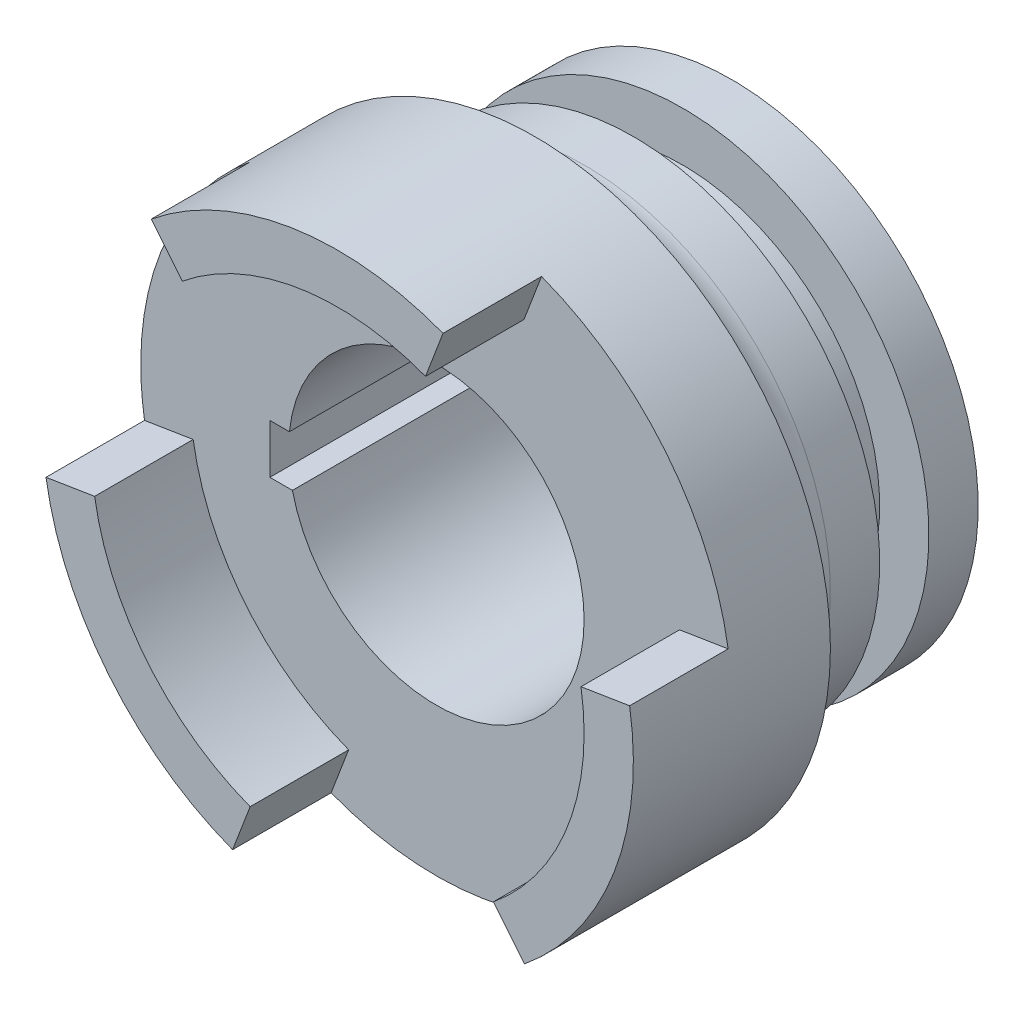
ISO-10303-21;
HEADER;
FILE_DESCRIPTION(('STEP AP214'),'2;1');
FILE_NAME('part.step','',(''),(''),'','','');
FILE_SCHEMA(('AUTOMOTIVE_DESIGN { 1 0 10303 214 1 1 1 1 }'));
ENDSEC;
DATA;
#1=APPLICATION_CONTEXT('core data for automotive mechanical design processes');
#2=APPLICATION_PROTOCOL_DEFINITION('international standard','automotive_design',2000,#1);
#3=PRODUCT_CONTEXT('',#1,'mechanical');
#4=PRODUCT('Part','Part','',(#3));
#5=PRODUCT_RELATED_PRODUCT_CATEGORY('part','',(#4));
#6=PRODUCT_DEFINITION_FORMATION('','',#4);
#7=PRODUCT_DEFINITION_CONTEXT('part definition',#1,'design');
#8=PRODUCT_DEFINITION('design','',#6,#7);
#9=PRODUCT_DEFINITION_SHAPE('','',#8);
#10=(LENGTH_UNIT() NAMED_UNIT(*) SI_UNIT(.MILLI.,.METRE.));
#11=(NAMED_UNIT(*) PLANE_ANGLE_UNIT() SI_UNIT($,.RADIAN.));
#12=(NAMED_UNIT(*) SI_UNIT($,.STERADIAN.) SOLID_ANGLE_UNIT());
#13=UNCERTAINTY_MEASURE_WITH_UNIT(LENGTH_MEASURE(1.E-05),#10,'distance_accuracy_value','');
#14=(GEOMETRIC_REPRESENTATION_CONTEXT(3) GLOBAL_UNCERTAINTY_ASSIGNED_CONTEXT((#13)) GLOBAL_UNIT_ASSIGNED_CONTEXT((#10,
#11,#12)) REPRESENTATION_CONTEXT('',''));
#15=CARTESIAN_POINT('',(0.,0.,0.));
#16=DIRECTION('',(0.,0.,1.));
#17=DIRECTION('',(1.,0.,0.));
#18=AXIS2_PLACEMENT_3D('',#15,#16,#17);
#19=CARTESIAN_POINT('',(-15.8914883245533,-142.169371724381,51.980983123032));
#20=DIRECTION('',(0.,0.,-1.));
#21=DIRECTION('',(-1.,0.,0.));
#22=AXIS2_PLACEMENT_3D('',#19,#20,#21);
#23=PLANE('',#22);
#24=DIRECTION('',(1.,0.,0.));
#25=VECTOR('',#24,1.);
#26=CARTESIAN_POINT('',(-15.8914883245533,-140.578462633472,51.980983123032));
#27=LINE('',#26,#25);
#28=CARTESIAN_POINT('',(-32.7868129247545,-140.578462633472,51.980983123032));
#29=VERTEX_POINT('',#28);
#30=CARTESIAN_POINT('',(-30.8068833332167,-140.578462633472,51.980983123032));
#31=VERTEX_POINT('',#30);
#32=EDGE_CURVE('E176',#29,#31,#27,.T.);
#33=ORIENTED_EDGE('',*,*,#32,.T.);
#34=CARTESIAN_POINT('',(-15.8914883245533,-142.169371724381,51.980983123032));
#35=DIRECTION('',(0.,0.,-1.));
#36=DIRECTION('',(-1.,0.,0.));
#37=AXIS2_PLACEMENT_3D('',#34,#35,#36);
#38=CIRCLE('',#37,15.);
#39=CARTESIAN_POINT('',(-30.4989555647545,-145.578462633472,51.980983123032));
#40=VERTEX_POINT('',#39);
#41=EDGE_CURVE('E179',#31,#40,#38,.T.);
#42=ORIENTED_EDGE('',*,*,#41,.T.);
#43=DIRECTION('',(-1.,0.,0.));
#44=VECTOR('',#43,1.);
#45=CARTESIAN_POINT('',(-15.8914883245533,-145.578462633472,51.980983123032));
#46=LINE('',#45,#44);
#47=CARTESIAN_POINT('',(-32.7868129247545,-145.578462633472,51.980983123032));
#48=VERTEX_POINT('',#47);
#49=EDGE_CURVE('E171',#40,#48,#46,.T.);
#50=ORIENTED_EDGE('',*,*,#49,.T.);
#51=DIRECTION('',(0.,1.,0.));
#52=VECTOR('',#51,1.);
#53=CARTESIAN_POINT('',(-32.7868129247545,-142.169371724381,51.980983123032));
#54=LINE('',#53,#52);
#55=EDGE_CURVE('E151',#48,#29,#54,.T.);
#56=ORIENTED_EDGE('',*,*,#55,.T.);
#57=EDGE_LOOP('',(#33,#42,#50,#56));
#58=FACE_BOUND('',#57,.T.);
#59=DIRECTION('',(0.355977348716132,0.934494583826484,0.));
#60=VECTOR('',#59,1.);
#61=CARTESIAN_POINT('',(-26.5708087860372,-170.204209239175,51.980983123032));
#62=LINE('',#61,#60);
#63=CARTESIAN_POINT('',(-26.5708087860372,-170.204209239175,51.980983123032));
#64=VERTEX_POINT('',#63);
#65=CARTESIAN_POINT('',(-24.7909220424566,-165.531736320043,51.980983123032));
#66=VERTEX_POINT('',#65);
#67=EDGE_CURVE('E197',#64,#66,#62,.T.);
#68=ORIENTED_EDGE('',*,*,#67,.F.);
#69=CARTESIAN_POINT('',(-15.8914883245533,-142.169371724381,51.980983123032));
#70=DIRECTION('',(0.,0.,-1.));
#71=DIRECTION('',(-1.,0.,0.));
#72=AXIS2_PLACEMENT_3D('',#69,#70,#71);
#73=CIRCLE('',#72,30.);
#74=CARTESIAN_POINT('',(3.04773292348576,-165.435353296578,51.980983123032));
#75=VERTEX_POINT('',#74);
#76=EDGE_CURVE('E261',#75,#64,#73,.T.);
#77=ORIENTED_EDGE('',*,*,#76,.F.);
#78=DIRECTION('',(0.631307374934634,-0.775532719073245,0.));
#79=VECTOR('',#78,1.);
#80=CARTESIAN_POINT('',(3.04773292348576,-165.435353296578,51.980983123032));
#81=LINE('',#80,#79);
#82=CARTESIAN_POINT('',(-0.108803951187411,-161.557689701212,51.980983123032));
#83=VERTEX_POINT('',#82);
#84=EDGE_CURVE('E228',#83,#75,#81,.T.);
#85=ORIENTED_EDGE('',*,*,#84,.F.);
#86=CARTESIAN_POINT('',(-15.8914883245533,-142.169371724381,51.980983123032));
#87=DIRECTION('',(0.,0.,-1.));
#88=DIRECTION('',(-1.,0.,0.));
#89=AXIS2_PLACEMENT_3D('',#86,#87,#88);
#90=CIRCLE('',#89,25.);
#91=CARTESIAN_POINT('',(8.79062976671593,-138.19532510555,51.980983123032));
#92=VERTEX_POINT('',#91);
#93=EDGE_CURVE('E237',#92,#83,#90,.T.);
#94=ORIENTED_EDGE('',*,*,#93,.F.);
#95=DIRECTION('',(-0.987284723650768,-0.15896186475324,0.));
#96=VECTOR('',#95,1.);
#97=CARTESIAN_POINT('',(13.7270533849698,-137.400515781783,51.980983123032));
#98=LINE('',#97,#96);
#99=CARTESIAN_POINT('',(13.7270533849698,-137.400515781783,51.980983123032));
#100=VERTEX_POINT('',#99);
#101=EDGE_CURVE('E223',#100,#92,#98,.T.);
#102=ORIENTED_EDGE('',*,*,#101,.F.);
#103=CARTESIAN_POINT('',(-5.21216786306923,-114.134534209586,51.980983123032));
#104=VERTEX_POINT('',#103);
#105=EDGE_CURVE('E258',#104,#100,#73,.T.);
#106=ORIENTED_EDGE('',*,*,#105,.F.);
#107=DIRECTION('',(0.355977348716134,0.934494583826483,0.));
#108=VECTOR('',#107,1.);
#109=CARTESIAN_POINT('',(-5.21216786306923,-114.134534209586,51.980983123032));
#110=LINE('',#109,#108);
#111=CARTESIAN_POINT('',(-6.9920546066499,-118.807007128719,51.980983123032));
#112=VERTEX_POINT('',#111);
#113=EDGE_CURVE('E266',#112,#104,#110,.T.);
#114=ORIENTED_EDGE('',*,*,#113,.F.);
#115=CARTESIAN_POINT('',(-15.8914883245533,-142.169371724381,51.980983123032));
#116=DIRECTION('',(0.,0.,-1.));
#117=DIRECTION('',(-1.,0.,0.));
#118=AXIS2_PLACEMENT_3D('',#115,#116,#117);
#119=CIRCLE('',#118,25.);
#120=CARTESIAN_POINT('',(-31.6741726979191,-122.78105374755,51.980983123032));
#121=VERTEX_POINT('',#120);
#122=EDGE_CURVE('E275',#121,#112,#119,.T.);
#123=ORIENTED_EDGE('',*,*,#122,.F.);
#124=DIRECTION('',(0.631307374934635,-0.775532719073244,0.));
#125=VECTOR('',#124,1.);
#126=CARTESIAN_POINT('',(-34.8307095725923,-118.903390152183,51.980983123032));
#127=LINE('',#126,#125);
#128=CARTESIAN_POINT('',(-34.8307095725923,-118.903390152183,51.980983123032));
#129=VERTEX_POINT('',#128);
#130=EDGE_CURVE('E257',#129,#121,#127,.T.);
#131=ORIENTED_EDGE('',*,*,#130,.F.);
#132=CARTESIAN_POINT('',(-45.5100300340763,-146.938227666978,51.980983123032));
#133=VERTEX_POINT('',#132);
#134=EDGE_CURVE('E253',#133,#129,#73,.T.);
#135=ORIENTED_EDGE('',*,*,#134,.F.);
#136=DIRECTION('',(-0.987284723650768,-0.158961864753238,0.));
#137=VECTOR('',#136,1.);
#138=CARTESIAN_POINT('',(-45.5100300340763,-146.938227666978,51.980983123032));
#139=LINE('',#138,#137);
#140=CARTESIAN_POINT('',(-40.5736064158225,-146.143418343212,51.980983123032));
#141=VERTEX_POINT('',#140);
#142=EDGE_CURVE('E202',#141,#133,#139,.T.);
#143=ORIENTED_EDGE('',*,*,#142,.F.);
#144=CARTESIAN_POINT('',(-15.8914883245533,-142.169371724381,51.980983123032));
#145=DIRECTION('',(0.,0.,-1.));
#146=DIRECTION('',(-1.,0.,0.));
#147=AXIS2_PLACEMENT_3D('',#144,#145,#146);
#148=CIRCLE('',#147,25.);
#149=EDGE_CURVE('E210',#66,#141,#148,.T.);
#150=ORIENTED_EDGE('',*,*,#149,.F.);
#151=EDGE_LOOP('',(#68,#77,#85,#94,#102,#106,#114,#123,#131,#135,#143,#150));
#152=FACE_BOUND('',#151,.T.);
#153=ADVANCED_FACE('F32',(#58,#152),#23,.F.);
#154=CARTESIAN_POINT('',(-15.8914883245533,-142.169371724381,61.980983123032));
#155=DIRECTION('',(0.,0.,-1.));
#156=DIRECTION('',(-1.,0.,0.));
#157=AXIS2_PLACEMENT_3D('',#154,#155,#156);
#158=CYLINDRICAL_SURFACE('',#157,30.);
#159=DIRECTION('',(0.,0.,-1.));
#160=VECTOR('',#159,1.);
#161=CARTESIAN_POINT('',(-5.21216786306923,-114.134534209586,61.980983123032));
#162=LINE('',#161,#160);
#163=CARTESIAN_POINT('',(-5.21216786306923,-114.134534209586,61.980983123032));
#164=VERTEX_POINT('',#163);
#165=EDGE_CURVE('E272',#164,#104,#162,.T.);
#166=ORIENTED_EDGE('',*,*,#165,.T.);
#167=ORIENTED_EDGE('',*,*,#105,.T.);
#168=DIRECTION('',(0.,0.,-1.));
#169=VECTOR('',#168,1.);
#170=CARTESIAN_POINT('',(13.7270533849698,-137.400515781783,61.980983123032));
#171=LINE('',#170,#169);
#172=CARTESIAN_POINT('',(13.7270533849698,-137.400515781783,61.980983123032));
#173=VERTEX_POINT('',#172);
#174=EDGE_CURVE('E250',#173,#100,#171,.T.);
#175=ORIENTED_EDGE('',*,*,#174,.F.);
#176=CARTESIAN_POINT('',(-15.8914883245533,-142.169371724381,61.980983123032));
#177=DIRECTION('',(0.,0.,1.));
#178=DIRECTION('',(1.,0.,0.));
#179=AXIS2_PLACEMENT_3D('',#176,#177,#178);
#180=CIRCLE('',#179,30.);
#181=CARTESIAN_POINT('',(3.04773292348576,-165.435353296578,61.980983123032));
#182=VERTEX_POINT('',#181);
#183=EDGE_CURVE('E224',#182,#173,#180,.T.);
#184=ORIENTED_EDGE('',*,*,#183,.F.);
#185=DIRECTION('',(0.,0.,-1.));
#186=VECTOR('',#185,1.);
#187=CARTESIAN_POINT('',(3.04773292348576,-165.435353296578,61.980983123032));
#188=LINE('',#187,#186);
#189=EDGE_CURVE('E234',#182,#75,#188,.T.);
#190=ORIENTED_EDGE('',*,*,#189,.T.);
#191=ORIENTED_EDGE('',*,*,#76,.T.);
#192=DIRECTION('',(0.,0.,-1.));
#193=VECTOR('',#192,1.);
#194=CARTESIAN_POINT('',(-26.5708087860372,-170.204209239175,61.980983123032));
#195=LINE('',#194,#193);
#196=CARTESIAN_POINT('',(-26.5708087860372,-170.204209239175,61.980983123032));
#197=VERTEX_POINT('',#196);
#198=EDGE_CURVE('E221',#197,#64,#195,.T.);
#199=ORIENTED_EDGE('',*,*,#198,.F.);
#200=CARTESIAN_POINT('',(-15.8914883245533,-142.169371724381,61.980983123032));
#201=DIRECTION('',(0.,0.,1.));
#202=DIRECTION('',(1.,0.,0.));
#203=AXIS2_PLACEMENT_3D('',#200,#201,#202);
#204=CIRCLE('',#203,30.);
#205=CARTESIAN_POINT('',(-45.5100300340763,-146.938227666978,61.980983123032));
#206=VERTEX_POINT('',#205);
#207=EDGE_CURVE('E198',#206,#197,#204,.T.);
#208=ORIENTED_EDGE('',*,*,#207,.F.);
#209=DIRECTION('',(0.,0.,-1.));
#210=VECTOR('',#209,1.);
#211=CARTESIAN_POINT('',(-45.5100300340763,-146.938227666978,61.980983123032));
#212=LINE('',#211,#210);
#213=EDGE_CURVE('E208',#206,#133,#212,.T.);
#214=ORIENTED_EDGE('',*,*,#213,.T.);
#215=ORIENTED_EDGE('',*,*,#134,.T.);
#216=DIRECTION('',(0.,0.,-1.));
#217=VECTOR('',#216,1.);
#218=CARTESIAN_POINT('',(-34.8307095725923,-118.903390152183,61.980983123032));
#219=LINE('',#218,#217);
#220=CARTESIAN_POINT('',(-34.8307095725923,-118.903390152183,61.980983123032));
#221=VERTEX_POINT('',#220);
#222=EDGE_CURVE('E40',#221,#129,#219,.T.);
#223=ORIENTED_EDGE('',*,*,#222,.F.);
#224=CARTESIAN_POINT('',(-15.8914883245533,-142.169371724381,61.980983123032));
#225=DIRECTION('',(0.,0.,1.));
#226=DIRECTION('',(1.,0.,0.));
#227=AXIS2_PLACEMENT_3D('',#224,#225,#226);
#228=CIRCLE('',#227,30.);
#229=EDGE_CURVE('E262',#164,#221,#228,.T.);
#230=ORIENTED_EDGE('',*,*,#229,.F.);
#231=EDGE_LOOP('',(#166,#167,#175,#184,#190,#191,#199,#208,#214,#215,#223,#230));
#232=FACE_BOUND('',#231,.T.);
#233=CARTESIAN_POINT('',(-15.8914883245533,-142.169371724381,41.980983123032));
#234=DIRECTION('',(0.,0.,-1.));
#235=DIRECTION('',(-1.,0.,0.));
#236=AXIS2_PLACEMENT_3D('',#233,#234,#235);
#237=CIRCLE('',#236,30.);
#238=CARTESIAN_POINT('',(-45.8914883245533,-142.169371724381,41.980983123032));
#239=VERTEX_POINT('',#238);
#240=EDGE_CURVE('E254',#239,#239,#237,.T.);
#241=ORIENTED_EDGE('',*,*,#240,.F.);
#242=EDGE_LOOP('',(#241));
#243=FACE_BOUND('',#242,.T.);
#244=ADVANCED_FACE('F295',(#232,#243),#158,.T.);
#245=CARTESIAN_POINT('',(-34.8307095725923,-118.903390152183,61.980983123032));
#246=DIRECTION('',(0.775532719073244,0.631307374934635,0.));
#247=DIRECTION('',(-0.631307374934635,0.775532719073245,0.));
#248=AXIS2_PLACEMENT_3D('',#245,#246,#247);
#249=PLANE('',#248);
#250=ORIENTED_EDGE('',*,*,#130,.T.);
#251=DIRECTION('',(0.,0.,-1.));
#252=VECTOR('',#251,1.);
#253=CARTESIAN_POINT('',(-31.6741726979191,-122.78105374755,61.980983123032));
#254=LINE('',#253,#252);
#255=CARTESIAN_POINT('',(-31.6741726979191,-122.78105374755,61.980983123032));
#256=VERTEX_POINT('',#255);
#257=EDGE_CURVE('E285',#256,#121,#254,.T.);
#258=ORIENTED_EDGE('',*,*,#257,.F.);
#259=DIRECTION('',(0.631307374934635,-0.775532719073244,0.));
#260=VECTOR('',#259,1.);
#261=CARTESIAN_POINT('',(-34.8307095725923,-118.903390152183,61.980983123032));
#262=LINE('',#261,#260);
#263=EDGE_CURVE('E265',#221,#256,#262,.T.);
#264=ORIENTED_EDGE('',*,*,#263,.F.);
#265=ORIENTED_EDGE('',*,*,#222,.T.);
#266=EDGE_LOOP('',(#250,#258,#264,#265));
#267=FACE_BOUND('',#266,.T.);
#268=ADVANCED_FACE('F290',(#267),#249,.F.);
#269=CARTESIAN_POINT('',(-15.8914883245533,-142.169371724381,61.980983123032));
#270=DIRECTION('',(0.,0.,-1.));
#271=DIRECTION('',(-1.,0.,0.));
#272=AXIS2_PLACEMENT_3D('',#269,#270,#271);
#273=CYLINDRICAL_SURFACE('',#272,25.);
#274=ORIENTED_EDGE('',*,*,#122,.T.);
#275=DIRECTION('',(0.,0.,-1.));
#276=VECTOR('',#275,1.);
#277=CARTESIAN_POINT('',(-6.9920546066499,-118.807007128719,61.980983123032));
#278=LINE('',#277,#276);
#279=CARTESIAN_POINT('',(-6.9920546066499,-118.807007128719,61.980983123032));
#280=VERTEX_POINT('',#279);
#281=EDGE_CURVE('E282',#280,#112,#278,.T.);
#282=ORIENTED_EDGE('',*,*,#281,.F.);
#283=CARTESIAN_POINT('',(-15.8914883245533,-142.169371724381,61.980983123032));
#284=DIRECTION('',(0.,0.,-1.));
#285=DIRECTION('',(-1.,0.,0.));
#286=AXIS2_PLACEMENT_3D('',#283,#284,#285);
#287=CIRCLE('',#286,25.);
#288=EDGE_CURVE('E268',#256,#280,#287,.T.);
#289=ORIENTED_EDGE('',*,*,#288,.F.);
#290=ORIENTED_EDGE('',*,*,#257,.T.);
#291=EDGE_LOOP('',(#274,#282,#289,#290));
#292=FACE_BOUND('',#291,.T.);
#293=ADVANCED_FACE('F305',(#292),#273,.F.);
#294=CARTESIAN_POINT('',(-5.21216786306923,-114.134534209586,61.980983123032));
#295=DIRECTION('',(-0.934494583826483,0.355977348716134,0.));
#296=DIRECTION('',(-0.355977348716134,-0.934494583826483,0.));
#297=AXIS2_PLACEMENT_3D('',#294,#295,#296);
#298=PLANE('',#297);
#299=ORIENTED_EDGE('',*,*,#113,.T.);
#300=ORIENTED_EDGE('',*,*,#165,.F.);
#301=DIRECTION('',(0.355977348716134,0.934494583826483,0.));
#302=VECTOR('',#301,1.);
#303=CARTESIAN_POINT('',(-5.21216786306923,-114.134534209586,61.980983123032));
#304=LINE('',#303,#302);
#305=EDGE_CURVE('E270',#280,#164,#304,.T.);
#306=ORIENTED_EDGE('',*,*,#305,.F.);
#307=ORIENTED_EDGE('',*,*,#281,.T.);
#308=EDGE_LOOP('',(#299,#300,#306,#307));
#309=FACE_BOUND('',#308,.T.);
#310=ADVANCED_FACE('F309',(#309),#298,.F.);
#311=CARTESIAN_POINT('',(-15.8914883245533,-142.169371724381,61.980983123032));
#312=DIRECTION('',(0.,0.,1.));
#313=DIRECTION('',(1.,0.,0.));
#314=AXIS2_PLACEMENT_3D('',#311,#312,#313);
#315=PLANE('',#314);
#316=ORIENTED_EDGE('',*,*,#229,.T.);
#317=ORIENTED_EDGE('',*,*,#263,.T.);
#318=ORIENTED_EDGE('',*,*,#288,.T.);
#319=ORIENTED_EDGE('',*,*,#305,.T.);
#320=EDGE_LOOP('',(#316,#317,#318,#319));
#321=FACE_BOUND('',#320,.T.);
#322=ADVANCED_FACE('F312',(#321),#315,.T.);
#323=CARTESIAN_POINT('',(13.7270533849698,-137.400515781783,61.980983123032));
#324=DIRECTION('',(0.15896186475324,-0.987284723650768,0.));
#325=DIRECTION('',(0.987284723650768,0.15896186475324,0.));
#326=AXIS2_PLACEMENT_3D('',#323,#324,#325);
#327=PLANE('',#326);
#328=ORIENTED_EDGE('',*,*,#101,.T.);
#329=DIRECTION('',(0.,0.,-1.));
#330=VECTOR('',#329,1.);
#331=CARTESIAN_POINT('',(8.79062976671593,-138.19532510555,61.980983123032));
#332=LINE('',#331,#330);
#333=CARTESIAN_POINT('',(8.79062976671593,-138.19532510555,61.980983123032));
#334=VERTEX_POINT('',#333);
#335=EDGE_CURVE('E247',#334,#92,#332,.T.);
#336=ORIENTED_EDGE('',*,*,#335,.F.);
#337=DIRECTION('',(-0.987284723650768,-0.15896186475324,0.));
#338=VECTOR('',#337,1.);
#339=CARTESIAN_POINT('',(13.7270533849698,-137.400515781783,61.980983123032));
#340=LINE('',#339,#338);
#341=EDGE_CURVE('E227',#173,#334,#340,.T.);
#342=ORIENTED_EDGE('',*,*,#341,.F.);
#343=ORIENTED_EDGE('',*,*,#174,.T.);
#344=EDGE_LOOP('',(#328,#336,#342,#343));
#345=FACE_BOUND('',#344,.T.);
#346=ADVANCED_FACE('F314',(#345),#327,.F.);
#347=CARTESIAN_POINT('',(-15.8914883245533,-142.169371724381,61.980983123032));
#348=DIRECTION('',(0.,0.,-1.));
#349=DIRECTION('',(-1.,0.,0.));
#350=AXIS2_PLACEMENT_3D('',#347,#348,#349);
#351=CYLINDRICAL_SURFACE('',#350,25.);
#352=ORIENTED_EDGE('',*,*,#93,.T.);
#353=DIRECTION('',(0.,0.,-1.));
#354=VECTOR('',#353,1.);
#355=CARTESIAN_POINT('',(-0.108803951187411,-161.557689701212,61.980983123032));
#356=LINE('',#355,#354);
#357=CARTESIAN_POINT('',(-0.108803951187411,-161.557689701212,61.980983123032));
#358=VERTEX_POINT('',#357);
#359=EDGE_CURVE('E244',#358,#83,#356,.T.);
#360=ORIENTED_EDGE('',*,*,#359,.F.);
#361=CARTESIAN_POINT('',(-15.8914883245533,-142.169371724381,61.980983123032));
#362=DIRECTION('',(0.,0.,-1.));
#363=DIRECTION('',(-1.,0.,0.));
#364=AXIS2_PLACEMENT_3D('',#361,#362,#363);
#365=CIRCLE('',#364,25.);
#366=EDGE_CURVE('E230',#334,#358,#365,.T.);
#367=ORIENTED_EDGE('',*,*,#366,.F.);
#368=ORIENTED_EDGE('',*,*,#335,.T.);
#369=EDGE_LOOP('',(#352,#360,#367,#368));
#370=FACE_BOUND('',#369,.T.);
#371=ADVANCED_FACE('F320',(#370),#351,.F.);
#372=CARTESIAN_POINT('',(3.04773292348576,-165.435353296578,61.980983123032));
#373=DIRECTION('',(0.775532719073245,0.631307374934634,0.));
#374=DIRECTION('',(-0.631307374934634,0.775532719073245,0.));
#375=AXIS2_PLACEMENT_3D('',#372,#373,#374);
#376=PLANE('',#375);
#377=ORIENTED_EDGE('',*,*,#84,.T.);
#378=ORIENTED_EDGE('',*,*,#189,.F.);
#379=DIRECTION('',(0.631307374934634,-0.775532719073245,0.));
#380=VECTOR('',#379,1.);
#381=CARTESIAN_POINT('',(3.04773292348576,-165.435353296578,61.980983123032));
#382=LINE('',#381,#380);
#383=EDGE_CURVE('E232',#358,#182,#382,.T.);
#384=ORIENTED_EDGE('',*,*,#383,.F.);
#385=ORIENTED_EDGE('',*,*,#359,.T.);
#386=EDGE_LOOP('',(#377,#378,#384,#385));
#387=FACE_BOUND('',#386,.T.);
#388=ADVANCED_FACE('F333',(#387),#376,.F.);
#389=CARTESIAN_POINT('',(-15.8914883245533,-142.169371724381,61.980983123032));
#390=DIRECTION('',(0.,0.,1.));
#391=DIRECTION('',(1.,0.,0.));
#392=AXIS2_PLACEMENT_3D('',#389,#390,#391);
#393=PLANE('',#392);
#394=ORIENTED_EDGE('',*,*,#183,.T.);
#395=ORIENTED_EDGE('',*,*,#341,.T.);
#396=ORIENTED_EDGE('',*,*,#366,.T.);
#397=ORIENTED_EDGE('',*,*,#383,.T.);
#398=EDGE_LOOP('',(#394,#395,#396,#397));
#399=FACE_BOUND('',#398,.T.);
#400=ADVANCED_FACE('F337',(#399),#393,.T.);
#401=CARTESIAN_POINT('',(-26.5708087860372,-170.204209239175,61.980983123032));
#402=DIRECTION('',(-0.934494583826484,0.355977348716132,0.));
#403=DIRECTION('',(-0.355977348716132,-0.934494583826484,0.));
#404=AXIS2_PLACEMENT_3D('',#401,#402,#403);
#405=PLANE('',#404);
#406=ORIENTED_EDGE('',*,*,#67,.T.);
#407=DIRECTION('',(0.,0.,-1.));
#408=VECTOR('',#407,1.);
#409=CARTESIAN_POINT('',(-24.7909220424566,-165.531736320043,61.980983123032));
#410=LINE('',#409,#408);
#411=CARTESIAN_POINT('',(-24.7909220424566,-165.531736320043,61.980983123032));
#412=VERTEX_POINT('',#411);
#413=EDGE_CURVE('E218',#412,#66,#410,.T.);
#414=ORIENTED_EDGE('',*,*,#413,.F.);
#415=DIRECTION('',(0.355977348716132,0.934494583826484,0.));
#416=VECTOR('',#415,1.);
#417=CARTESIAN_POINT('',(-26.5708087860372,-170.204209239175,61.980983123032));
#418=LINE('',#417,#416);
#419=EDGE_CURVE('E201',#197,#412,#418,.T.);
#420=ORIENTED_EDGE('',*,*,#419,.F.);
#421=ORIENTED_EDGE('',*,*,#198,.T.);
#422=EDGE_LOOP('',(#406,#414,#420,#421));
#423=FACE_BOUND('',#422,.T.);
#424=ADVANCED_FACE('F341',(#423),#405,.F.);
#425=CARTESIAN_POINT('',(-15.8914883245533,-142.169371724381,61.980983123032));
#426=DIRECTION('',(0.,0.,-1.));
#427=DIRECTION('',(-1.,0.,0.));
#428=AXIS2_PLACEMENT_3D('',#425,#426,#427);
#429=CYLINDRICAL_SURFACE('',#428,25.);
#430=ORIENTED_EDGE('',*,*,#149,.T.);
#431=DIRECTION('',(0.,0.,-1.));
#432=VECTOR('',#431,1.);
#433=CARTESIAN_POINT('',(-40.5736064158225,-146.143418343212,61.980983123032));
#434=LINE('',#433,#432);
#435=CARTESIAN_POINT('',(-40.5736064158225,-146.143418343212,61.980983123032));
#436=VERTEX_POINT('',#435);
#437=EDGE_CURVE('E215',#436,#141,#434,.T.);
#438=ORIENTED_EDGE('',*,*,#437,.F.);
#439=CARTESIAN_POINT('',(-15.8914883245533,-142.169371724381,61.980983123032));
#440=DIRECTION('',(0.,0.,-1.));
#441=DIRECTION('',(-1.,0.,0.));
#442=AXIS2_PLACEMENT_3D('',#439,#440,#441);
#443=CIRCLE('',#442,25.);
#444=EDGE_CURVE('E204',#412,#436,#443,.T.);
#445=ORIENTED_EDGE('',*,*,#444,.F.);
#446=ORIENTED_EDGE('',*,*,#413,.T.);
#447=EDGE_LOOP('',(#430,#438,#445,#446));
#448=FACE_BOUND('',#447,.T.);
#449=ADVANCED_FACE('F345',(#448),#429,.F.);
#450=CARTESIAN_POINT('',(-45.5100300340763,-146.938227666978,61.980983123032));
#451=DIRECTION('',(0.158961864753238,-0.987284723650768,0.));
#452=DIRECTION('',(0.987284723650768,0.158961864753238,0.));
#453=AXIS2_PLACEMENT_3D('',#450,#451,#452);
#454=PLANE('',#453);
#455=ORIENTED_EDGE('',*,*,#142,.T.);
#456=ORIENTED_EDGE('',*,*,#213,.F.);
#457=DIRECTION('',(-0.987284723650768,-0.158961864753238,0.));
#458=VECTOR('',#457,1.);
#459=CARTESIAN_POINT('',(-45.5100300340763,-146.938227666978,61.980983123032));
#460=LINE('',#459,#458);
#461=EDGE_CURVE('E206',#436,#206,#460,.T.);
#462=ORIENTED_EDGE('',*,*,#461,.F.);
#463=ORIENTED_EDGE('',*,*,#437,.T.);
#464=EDGE_LOOP('',(#455,#456,#462,#463));
#465=FACE_BOUND('',#464,.T.);
#466=ADVANCED_FACE('F349',(#465),#454,.F.);
#467=CARTESIAN_POINT('',(-15.8914883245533,-142.169371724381,61.980983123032));
#468=DIRECTION('',(0.,0.,1.));
#469=DIRECTION('',(1.,0.,0.));
#470=AXIS2_PLACEMENT_3D('',#467,#468,#469);
#471=PLANE('',#470);
#472=ORIENTED_EDGE('',*,*,#207,.T.);
#473=ORIENTED_EDGE('',*,*,#419,.T.);
#474=ORIENTED_EDGE('',*,*,#444,.T.);
#475=ORIENTED_EDGE('',*,*,#461,.T.);
#476=EDGE_LOOP('',(#472,#473,#474,#475));
#477=FACE_BOUND('',#476,.T.);
#478=ADVANCED_FACE('F353',(#477),#471,.T.);
#479=CARTESIAN_POINT('',(-15.8914883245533,-142.169371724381,31.980983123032));
#480=DIRECTION('',(0.,0.,1.));
#481=DIRECTION('',(1.,0.,0.));
#482=AXIS2_PLACEMENT_3D('',#479,#480,#481);
#483=CYLINDRICAL_SURFACE('',#482,25.);
#484=CARTESIAN_POINT('',(-15.8914883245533,-142.169371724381,36.980983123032));
#485=DIRECTION('',(0.,0.,-1.));
#486=DIRECTION('',(-1.,0.,0.));
#487=AXIS2_PLACEMENT_3D('',#484,#485,#486);
#488=CIRCLE('',#487,25.);
#489=CARTESIAN_POINT('',(-40.8914883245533,-142.169371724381,36.980983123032));
#490=VERTEX_POINT('',#489);
#491=EDGE_CURVE('E11',#490,#490,#488,.T.);
#492=ORIENTED_EDGE('',*,*,#491,.T.);
#493=EDGE_LOOP('',(#492));
#494=FACE_BOUND('',#493,.T.);
#495=CARTESIAN_POINT('',(-15.8914883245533,-142.169371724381,31.980983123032));
#496=DIRECTION('',(0.,0.,-1.));
#497=DIRECTION('',(-1.,0.,0.));
#498=AXIS2_PLACEMENT_3D('',#495,#496,#497);
#499=CIRCLE('',#498,25.);
#500=CARTESIAN_POINT('',(-40.8914883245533,-142.169371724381,31.980983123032));
#501=VERTEX_POINT('',#500);
#502=EDGE_CURVE('E192',#501,#501,#499,.T.);
#503=ORIENTED_EDGE('',*,*,#502,.F.);
#504=EDGE_LOOP('',(#503));
#505=FACE_BOUND('',#504,.T.);
#506=ADVANCED_FACE('F357',(#494,#505),#483,.T.);
#507=CARTESIAN_POINT('',(-15.8914883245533,-142.169371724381,31.980983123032));
#508=DIRECTION('',(0.,0.,-1.));
#509=DIRECTION('',(-1.,0.,0.));
#510=AXIS2_PLACEMENT_3D('',#507,#508,#509);
#511=PLANE('',#510);
#512=CARTESIAN_POINT('',(-15.8914883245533,-142.169371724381,31.980983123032));
#513=DIRECTION('',(0.,0.,-1.));
#514=DIRECTION('',(-1.,0.,0.));
#515=AXIS2_PLACEMENT_3D('',#512,#513,#514);
#516=CIRCLE('',#515,20.);
#517=CARTESIAN_POINT('',(-35.8914883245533,-142.169371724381,31.980983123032));
#518=VERTEX_POINT('',#517);
#519=EDGE_CURVE('E186',#518,#518,#516,.T.);
#520=ORIENTED_EDGE('',*,*,#519,.F.);
#521=EDGE_LOOP('',(#520));
#522=FACE_BOUND('',#521,.T.);
#523=ORIENTED_EDGE('',*,*,#502,.T.);
#524=EDGE_LOOP('',(#523));
#525=FACE_BOUND('',#524,.T.);
#526=ADVANCED_FACE('F361',(#522,#525),#511,.T.);
#527=CARTESIAN_POINT('',(-15.8914883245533,-142.169371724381,36.980983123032));
#528=DIRECTION('',(0.,0.,-1.));
#529=DIRECTION('',(-1.,0.,0.));
#530=AXIS2_PLACEMENT_3D('',#527,#528,#529);
#531=TOROIDAL_SURFACE('',#530,30.,5.);
#532=ORIENTED_EDGE('',*,*,#240,.T.);
#533=EDGE_LOOP('',(#532));
#534=FACE_BOUND('',#533,.T.);
#535=ORIENTED_EDGE('',*,*,#491,.F.);
#536=EDGE_LOOP('',(#535));
#537=FACE_BOUND('',#536,.T.);
#538=ADVANCED_FACE('F34',(#534,#537),#531,.F.);
#539=CARTESIAN_POINT('',(-15.8914883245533,-142.169371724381,26.980983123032));
#540=DIRECTION('',(0.,0.,1.));
#541=DIRECTION('',(1.,0.,0.));
#542=AXIS2_PLACEMENT_3D('',#539,#540,#541);
#543=CYLINDRICAL_SURFACE('',#542,20.);
#544=CARTESIAN_POINT('',(-15.8914883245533,-142.169371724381,26.980983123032));
#545=DIRECTION('',(0.,0.,-1.));
#546=DIRECTION('',(-1.,0.,0.));
#547=AXIS2_PLACEMENT_3D('',#544,#545,#546);
#548=CIRCLE('',#547,20.);
#549=CARTESIAN_POINT('',(-35.8914883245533,-142.169371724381,26.980983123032));
#550=VERTEX_POINT('',#549);
#551=EDGE_CURVE('E189',#550,#550,#548,.T.);
#552=ORIENTED_EDGE('',*,*,#551,.F.);
#553=EDGE_LOOP('',(#552));
#554=FACE_BOUND('',#553,.T.);
#555=ORIENTED_EDGE('',*,*,#519,.T.);
#556=EDGE_LOOP('',(#555));
#557=FACE_BOUND('',#556,.T.);
#558=ADVANCED_FACE('F366',(#554,#557),#543,.T.);
#559=CARTESIAN_POINT('',(-15.8914883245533,-142.169371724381,21.980983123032));
#560=DIRECTION('',(0.,0.,1.));
#561=DIRECTION('',(1.,0.,0.));
#562=AXIS2_PLACEMENT_3D('',#559,#560,#561);
#563=CYLINDRICAL_SURFACE('',#562,25.);
#564=CARTESIAN_POINT('',(-15.8914883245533,-142.169371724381,21.980983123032));
#565=DIRECTION('',(0.,0.,-1.));
#566=DIRECTION('',(-1.,0.,0.));
#567=AXIS2_PLACEMENT_3D('',#564,#565,#566);
#568=CIRCLE('',#567,25.);
#569=CARTESIAN_POINT('',(-40.8914883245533,-142.169371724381,21.980983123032));
#570=VERTEX_POINT('',#569);
#571=EDGE_CURVE('E183',#570,#570,#568,.T.);
#572=ORIENTED_EDGE('',*,*,#571,.F.);
#573=EDGE_LOOP('',(#572));
#574=FACE_BOUND('',#573,.T.);
#575=CARTESIAN_POINT('',(-15.8914883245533,-142.169371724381,26.980983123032));
#576=DIRECTION('',(0.,0.,-1.));
#577=DIRECTION('',(-1.,0.,0.));
#578=AXIS2_PLACEMENT_3D('',#575,#576,#577);
#579=CIRCLE('',#578,25.);
#580=CARTESIAN_POINT('',(-40.8914883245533,-142.169371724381,26.980983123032));
#581=VERTEX_POINT('',#580);
#582=EDGE_CURVE('E182',#581,#581,#579,.T.);
#583=ORIENTED_EDGE('',*,*,#582,.T.);
#584=EDGE_LOOP('',(#583));
#585=FACE_BOUND('',#584,.T.);
#586=ADVANCED_FACE('F369',(#574,#585),#563,.T.);
#587=CARTESIAN_POINT('',(-15.8914883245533,-142.169371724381,21.980983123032));
#588=DIRECTION('',(0.,0.,-1.));
#589=DIRECTION('',(-1.,0.,0.));
#590=AXIS2_PLACEMENT_3D('',#587,#588,#589);
#591=PLANE('',#590);
#592=CARTESIAN_POINT('',(-15.8914883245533,-142.169371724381,21.980983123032));
#593=DIRECTION('',(0.,0.,-1.));
#594=DIRECTION('',(-1.,0.,0.));
#595=AXIS2_PLACEMENT_3D('',#592,#593,#594);
#596=CIRCLE('',#595,15.);
#597=CARTESIAN_POINT('',(-30.8068833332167,-140.578462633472,21.980983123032));
#598=VERTEX_POINT('',#597);
#599=CARTESIAN_POINT('',(-30.4989555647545,-145.578462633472,21.980983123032));
#600=VERTEX_POINT('',#599);
#601=EDGE_CURVE('E55',#598,#600,#596,.T.);
#602=ORIENTED_EDGE('',*,*,#601,.F.);
#603=DIRECTION('',(1.,0.,0.));
#604=VECTOR('',#603,1.);
#605=CARTESIAN_POINT('',(-30.8068833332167,-140.578462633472,21.980983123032));
#606=LINE('',#605,#604);
#607=CARTESIAN_POINT('',(-32.7868129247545,-140.578462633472,21.980983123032));
#608=VERTEX_POINT('',#607);
#609=EDGE_CURVE('E164',#608,#598,#606,.T.);
#610=ORIENTED_EDGE('',*,*,#609,.F.);
#611=DIRECTION('',(0.,1.,0.));
#612=VECTOR('',#611,1.);
#613=CARTESIAN_POINT('',(-32.7868129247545,-140.578462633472,21.980983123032));
#614=LINE('',#613,#612);
#615=CARTESIAN_POINT('',(-32.7868129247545,-145.578462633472,21.980983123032));
#616=VERTEX_POINT('',#615);
#617=EDGE_CURVE('E148',#616,#608,#614,.T.);
#618=ORIENTED_EDGE('',*,*,#617,.F.);
#619=DIRECTION('',(-1.,0.,0.));
#620=VECTOR('',#619,1.);
#621=CARTESIAN_POINT('',(-30.4989555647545,-145.578462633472,21.980983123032));
#622=LINE('',#621,#620);
#623=EDGE_CURVE('E157',#600,#616,#622,.T.);
#624=ORIENTED_EDGE('',*,*,#623,.F.);
#625=EDGE_LOOP('',(#602,#610,#618,#624));
#626=FACE_BOUND('',#625,.T.);
#627=ORIENTED_EDGE('',*,*,#571,.T.);
#628=EDGE_LOOP('',(#627));
#629=FACE_BOUND('',#628,.T.);
#630=ADVANCED_FACE('F161',(#626,#629),#591,.T.);
#631=CARTESIAN_POINT('',(-15.8914883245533,-142.169371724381,26.980983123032));
#632=DIRECTION('',(0.,0.,-1.));
#633=DIRECTION('',(-1.,0.,0.));
#634=AXIS2_PLACEMENT_3D('',#631,#632,#633);
#635=PLANE('',#634);
#636=ORIENTED_EDGE('',*,*,#551,.T.);
#637=EDGE_LOOP('',(#636));
#638=FACE_BOUND('',#637,.T.);
#639=ORIENTED_EDGE('',*,*,#582,.F.);
#640=EDGE_LOOP('',(#639));
#641=FACE_BOUND('',#640,.T.);
#642=ADVANCED_FACE('F374',(#638,#641),#635,.F.);
#643=CARTESIAN_POINT('',(-15.8914883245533,-142.169371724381,61.980983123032));
#644=DIRECTION('',(0.,0.,-1.));
#645=DIRECTION('',(-1.,0.,0.));
#646=AXIS2_PLACEMENT_3D('',#643,#644,#645);
#647=CYLINDRICAL_SURFACE('',#646,15.);
#648=DIRECTION('',(0.,0.,-1.));
#649=VECTOR('',#648,1.);
#650=CARTESIAN_POINT('',(-30.8068833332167,-140.578462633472,61.980983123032));
#651=LINE('',#650,#649);
#652=EDGE_CURVE('E169',#31,#598,#651,.T.);
#653=ORIENTED_EDGE('',*,*,#652,.T.);
#654=ORIENTED_EDGE('',*,*,#601,.T.);
#655=DIRECTION('',(0.,0.,-1.));
#656=VECTOR('',#655,1.);
#657=CARTESIAN_POINT('',(-30.4989555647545,-145.578462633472,61.980983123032));
#658=LINE('',#657,#656);
#659=EDGE_CURVE('E154',#40,#600,#658,.T.);
#660=ORIENTED_EDGE('',*,*,#659,.F.);
#661=ORIENTED_EDGE('',*,*,#41,.F.);
#662=EDGE_LOOP('',(#653,#654,#660,#661));
#663=FACE_BOUND('',#662,.T.);
#664=ADVANCED_FACE('F377',(#663),#647,.F.);
#665=CARTESIAN_POINT('',(-30.8068833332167,-140.578462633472,61.980983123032));
#666=DIRECTION('',(0.,1.,0.));
#667=DIRECTION('',(0.,0.,1.));
#668=AXIS2_PLACEMENT_3D('',#665,#666,#667);
#669=PLANE('',#668);
#670=DIRECTION('',(0.,0.,-1.));
#671=VECTOR('',#670,1.);
#672=CARTESIAN_POINT('',(-32.7868129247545,-140.578462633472,61.980983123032));
#673=LINE('',#672,#671);
#674=EDGE_CURVE('E153',#29,#608,#673,.T.);
#675=ORIENTED_EDGE('',*,*,#674,.T.);
#676=ORIENTED_EDGE('',*,*,#609,.T.);
#677=ORIENTED_EDGE('',*,*,#652,.F.);
#678=ORIENTED_EDGE('',*,*,#32,.F.);
#679=EDGE_LOOP('',(#675,#676,#677,#678));
#680=FACE_BOUND('',#679,.T.);
#681=ADVANCED_FACE('F383',(#680),#669,.F.);
#682=CARTESIAN_POINT('',(-32.7868129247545,-140.578462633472,61.980983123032));
#683=DIRECTION('',(-1.,0.,0.));
#684=DIRECTION('',(0.,0.,1.));
#685=AXIS2_PLACEMENT_3D('',#682,#683,#684);
#686=PLANE('',#685);
#687=DIRECTION('',(0.,0.,-1.));
#688=VECTOR('',#687,1.);
#689=CARTESIAN_POINT('',(-32.7868129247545,-145.578462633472,61.980983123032));
#690=LINE('',#689,#688);
#691=EDGE_CURVE('E47',#48,#616,#690,.T.);
#692=ORIENTED_EDGE('',*,*,#691,.T.);
#693=ORIENTED_EDGE('',*,*,#617,.T.);
#694=ORIENTED_EDGE('',*,*,#674,.F.);
#695=ORIENTED_EDGE('',*,*,#55,.F.);
#696=EDGE_LOOP('',(#692,#693,#694,#695));
#697=FACE_BOUND('',#696,.T.);
#698=ADVANCED_FACE('F145',(#697),#686,.F.);
#699=CARTESIAN_POINT('',(-30.4989555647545,-145.578462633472,61.980983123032));
#700=DIRECTION('',(0.,-1.,0.));
#701=DIRECTION('',(0.,0.,-1.));
#702=AXIS2_PLACEMENT_3D('',#699,#700,#701);
#703=PLANE('',#702);
#704=ORIENTED_EDGE('',*,*,#659,.T.);
#705=ORIENTED_EDGE('',*,*,#623,.T.);
#706=ORIENTED_EDGE('',*,*,#691,.F.);
#707=ORIENTED_EDGE('',*,*,#49,.F.);
#708=EDGE_LOOP('',(#704,#705,#706,#707));
#709=FACE_BOUND('',#708,.T.);
#710=ADVANCED_FACE('F158',(#709),#703,.F.);
#711=CLOSED_SHELL('',(#153,#244,#268,#293,#310,#322,#346,#371,#388,#400,#424,#449,#466,#478,
#506,#526,#538,#558,#586,#630,#642,#664,#681,#698,#710));
#712=MANIFOLD_SOLID_BREP('B2',#711);
#713=ADVANCED_BREP_SHAPE_REPRESENTATION('',(#18,#712),#14);
#714=SHAPE_DEFINITION_REPRESENTATION(#9,#713);
ENDSEC;
END-ISO-10303-21;
